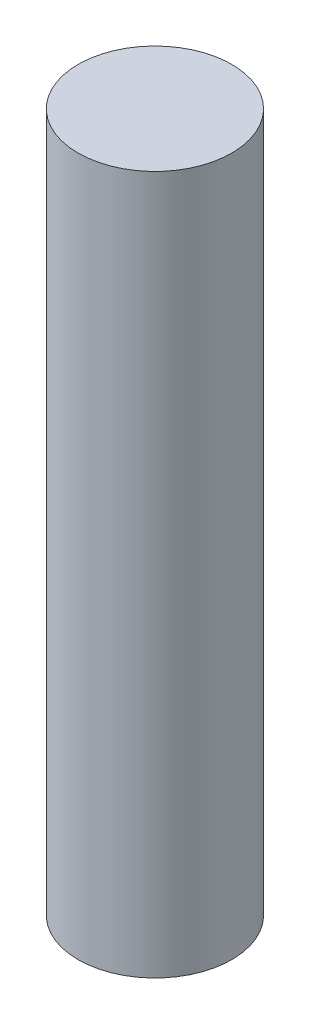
from build123d import *

# Parameters (mm, degrees)
ESQUISSE1_R            = 110
FORME_EXT_RIEURE_DEPTH = 1000


with BuildPart() as part:
    # Esquisse1 → Forme ext_rieure (new body)
    with BuildSketch(Plane(origin=(0, 0, 0), x_dir=(1, 0, 0), z_dir=(0, 1, 0))):
        with Locations(Location((0, 0, 0), (0, 0, 270))):
            Circle(ESQUISSE1_R)
    extrude(amount=FORME_EXT_RIEURE_DEPTH)


solid = part.part
